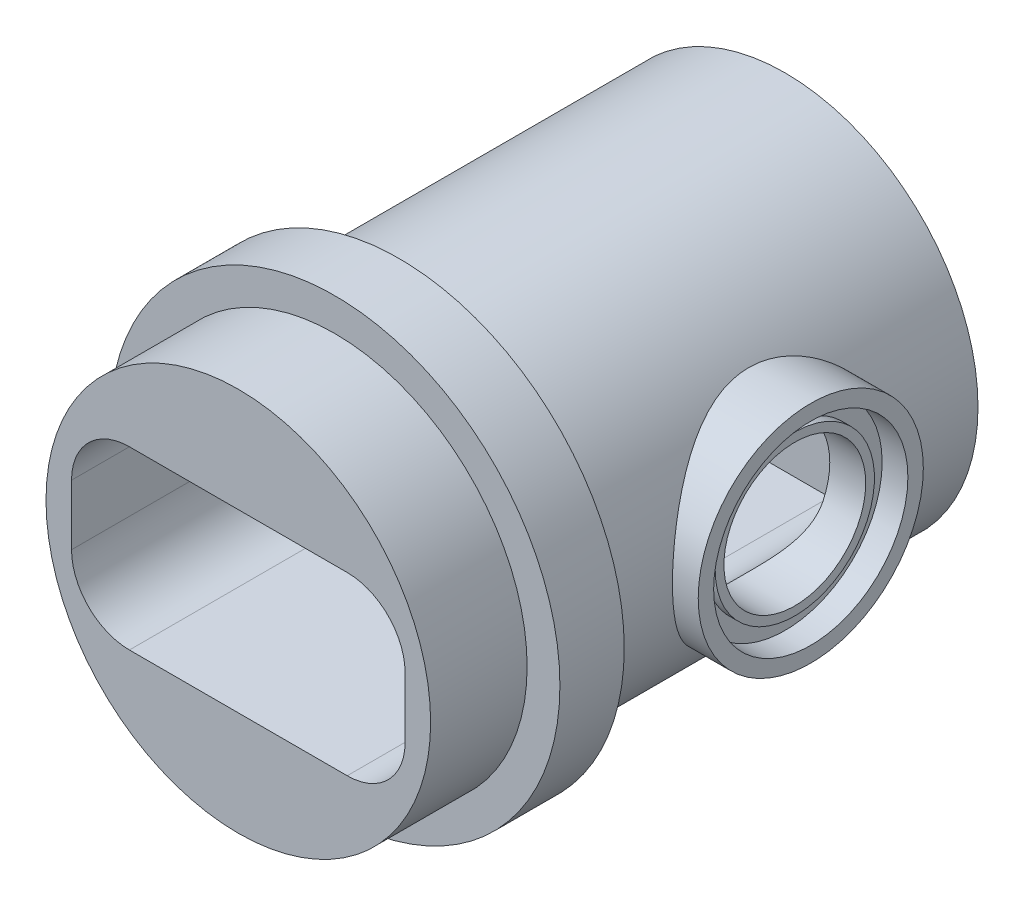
ISO-10303-21;
HEADER;
FILE_DESCRIPTION(('STEP AP214'),'2;1');
FILE_NAME('part.step','',(''),(''),'','','');
FILE_SCHEMA(('AUTOMOTIVE_DESIGN { 1 0 10303 214 1 1 1 1 }'));
ENDSEC;
DATA;
#1=APPLICATION_CONTEXT('core data for automotive mechanical design processes');
#2=APPLICATION_PROTOCOL_DEFINITION('international standard','automotive_design',2000,#1);
#3=PRODUCT_CONTEXT('',#1,'mechanical');
#4=PRODUCT('Part','Part','',(#3));
#5=PRODUCT_RELATED_PRODUCT_CATEGORY('part','',(#4));
#6=PRODUCT_DEFINITION_FORMATION('','',#4);
#7=PRODUCT_DEFINITION_CONTEXT('part definition',#1,'design');
#8=PRODUCT_DEFINITION('design','',#6,#7);
#9=PRODUCT_DEFINITION_SHAPE('','',#8);
#10=(LENGTH_UNIT() NAMED_UNIT(*) SI_UNIT(.MILLI.,.METRE.));
#11=(NAMED_UNIT(*) PLANE_ANGLE_UNIT() SI_UNIT($,.RADIAN.));
#12=(NAMED_UNIT(*) SI_UNIT($,.STERADIAN.) SOLID_ANGLE_UNIT());
#13=UNCERTAINTY_MEASURE_WITH_UNIT(LENGTH_MEASURE(1.E-05),#10,'distance_accuracy_value','');
#14=(GEOMETRIC_REPRESENTATION_CONTEXT(3) GLOBAL_UNCERTAINTY_ASSIGNED_CONTEXT((#13)) GLOBAL_UNIT_ASSIGNED_CONTEXT((#10,
#11,#12)) REPRESENTATION_CONTEXT('',''));
#15=CARTESIAN_POINT('',(0.,0.,0.));
#16=DIRECTION('',(0.,0.,1.));
#17=DIRECTION('',(1.,0.,0.));
#18=AXIS2_PLACEMENT_3D('',#15,#16,#17);
#19=CARTESIAN_POINT('',(38.1,0.,38.1));
#20=DIRECTION('',(1.,0.,0.));
#21=DIRECTION('',(0.,0.,-1.));
#22=AXIS2_PLACEMENT_3D('',#19,#20,#21);
#23=PLANE('',#22);
#24=CARTESIAN_POINT('',(38.1,0.,38.1));
#25=DIRECTION('',(1.,0.,0.));
#26=DIRECTION('',(0.,0.,-1.));
#27=AXIS2_PLACEMENT_3D('',#24,#25,#26);
#28=CIRCLE('',#27,19.177);
#29=CARTESIAN_POINT('',(38.1,0.,18.923));
#30=VERTEX_POINT('',#29);
#31=EDGE_CURVE('E466',#30,#30,#28,.T.);
#32=ORIENTED_EDGE('',*,*,#31,.T.);
#33=EDGE_LOOP('',(#32));
#34=FACE_BOUND('',#33,.T.);
#35=CARTESIAN_POINT('',(38.1,0.,38.1));
#36=DIRECTION('',(1.,0.,0.));
#37=DIRECTION('',(0.,0.,-1.));
#38=AXIS2_PLACEMENT_3D('',#35,#36,#37);
#39=CIRCLE('',#38,15.7226);
#40=CARTESIAN_POINT('',(38.1,0.,53.8226));
#41=VERTEX_POINT('',#40);
#42=EDGE_CURVE('E473',#41,#41,#39,.T.);
#43=ORIENTED_EDGE('',*,*,#42,.F.);
#44=EDGE_LOOP('',(#43));
#45=FACE_BOUND('',#44,.T.);
#46=ADVANCED_FACE('F51',(#34,#45),#23,.T.);
#47=CARTESIAN_POINT('',(11.938,0.,38.1));
#48=DIRECTION('',(1.,0.,0.));
#49=DIRECTION('',(0.,0.,-1.));
#50=AXIS2_PLACEMENT_3D('',#47,#48,#49);
#51=CYLINDRICAL_SURFACE('',#50,14.);
#52=CARTESIAN_POINT('',(32.9325,0.,38.1));
#53=DIRECTION('',(1.,0.,0.));
#54=DIRECTION('',(0.,0.,-1.));
#55=AXIS2_PLACEMENT_3D('',#52,#53,#54);
#56=CIRCLE('',#55,14.);
#57=CARTESIAN_POINT('',(32.9325,-5.94499999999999,25.424946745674));
#58=VERTEX_POINT('',#57);
#59=CARTESIAN_POINT('',(32.9325,5.945,25.424946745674));
#60=VERTEX_POINT('',#59);
#61=EDGE_CURVE('E72',#58,#60,#56,.T.);
#62=ORIENTED_EDGE('',*,*,#61,.F.);
#63=CARTESIAN_POINT('',(32.9325,-5.94499999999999,50.775053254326));
#64=CARTESIAN_POINT('',(32.9325016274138,-6.09733765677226,50.7036053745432));
#65=CARTESIAN_POINT('',(32.9294540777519,-6.24835146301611,50.6294205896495));
#66=CARTESIAN_POINT('',(32.9175950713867,-6.54740273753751,50.4757731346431));
#67=CARTESIAN_POINT('',(32.9087847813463,-6.69544080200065,50.3963115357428));
#68=CARTESIAN_POINT('',(32.8742504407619,-7.13416795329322,50.1505528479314));
#69=CARTESIAN_POINT('',(32.8404205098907,-7.42001555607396,49.9766256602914));
#70=CARTESIAN_POINT('',(32.7544721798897,-7.97374736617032,49.6120911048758));
#71=CARTESIAN_POINT('',(32.7025370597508,-8.24178068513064,49.4216647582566));
#72=CARTESIAN_POINT('',(32.5832044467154,-8.76174627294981,49.0242353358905));
#73=CARTESIAN_POINT('',(32.5158009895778,-9.01367228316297,48.8172258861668));
#74=CARTESIAN_POINT('',(32.3688898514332,-9.49892018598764,48.3895331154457));
#75=CARTESIAN_POINT('',(32.2894597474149,-9.73234766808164,48.168942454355));
#76=CARTESIAN_POINT('',(32.1209776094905,-10.1817941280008,47.7142218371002));
#77=CARTESIAN_POINT('',(32.0319266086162,-10.3978149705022,47.480093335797));
#78=CARTESIAN_POINT('',(31.8465725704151,-10.8129485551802,46.9984052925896));
#79=CARTESIAN_POINT('',(31.7502439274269,-11.0119958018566,46.7507992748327));
#80=CARTESIAN_POINT('',(31.5533563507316,-11.3921102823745,46.2437245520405));
#81=CARTESIAN_POINT('',(31.4527968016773,-11.5731748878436,45.9842541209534));
#82=CARTESIAN_POINT('',(31.228848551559,-11.9534480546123,45.3980538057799));
#83=CARTESIAN_POINT('',(31.1051229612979,-12.1484147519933,45.0686906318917));
#84=CARTESIAN_POINT('',(30.860782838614,-12.5112231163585,44.3941243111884));
#85=CARTESIAN_POINT('',(30.7401690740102,-12.6790581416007,44.0489173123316));
#86=CARTESIAN_POINT('',(30.5080085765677,-12.9865024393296,43.3438928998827));
#87=CARTESIAN_POINT('',(30.3964474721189,-13.1261569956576,42.9841000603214));
#88=CARTESIAN_POINT('',(30.1885420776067,-13.3762886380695,42.2502995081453));
#89=CARTESIAN_POINT('',(30.0921905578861,-13.4867796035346,41.8762986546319));
#90=CARTESIAN_POINT('',(29.9439931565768,-13.6518110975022,41.216279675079));
#91=CARTESIAN_POINT('',(29.8871160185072,-13.7134206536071,40.9331503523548));
#92=CARTESIAN_POINT('',(29.7878079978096,-13.8192528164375,40.3611495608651));
#93=CARTESIAN_POINT('',(29.745374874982,-13.8634781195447,40.0722789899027));
#94=CARTESIAN_POINT('',(29.6772409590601,-13.9337997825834,39.4909548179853));
#95=CARTESIAN_POINT('',(29.6515064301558,-13.9599327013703,39.1985096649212));
#96=CARTESIAN_POINT('',(29.618117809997,-13.99374054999,38.6115064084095));
#97=CARTESIAN_POINT('',(29.6104635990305,-14.0014156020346,38.316948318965));
#98=CARTESIAN_POINT('',(29.6137046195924,-13.9981524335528,37.7275200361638));
#99=CARTESIAN_POINT('',(29.6246325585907,-13.9871813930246,37.4326502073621));
#100=CARTESIAN_POINT('',(29.6644366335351,-13.9467797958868,36.8454204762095));
#101=CARTESIAN_POINT('',(29.6933130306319,-13.9173489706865,36.5530606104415));
#102=CARTESIAN_POINT('',(29.7674379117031,-13.8404757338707,35.9722736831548));
#103=CARTESIAN_POINT('',(29.8127178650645,-13.7929986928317,35.683855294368));
#104=CARTESIAN_POINT('',(29.9173166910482,-13.6807370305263,35.1130117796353));
#105=CARTESIAN_POINT('',(29.9766377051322,-13.6159497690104,34.8305875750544));
#106=CARTESIAN_POINT('',(30.1288599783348,-13.4448670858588,34.1776215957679));
#107=CARTESIAN_POINT('',(30.226314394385,-13.3319508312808,33.8098692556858));
#108=CARTESIAN_POINT('',(30.4352727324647,-13.0778470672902,33.0883795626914));
#109=CARTESIAN_POINT('',(30.5467819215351,-12.9366489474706,32.7346475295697));
#110=CARTESIAN_POINT('',(30.7780808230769,-12.6267642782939,32.0411717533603));
#111=CARTESIAN_POINT('',(30.8978899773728,-12.4580118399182,31.7014640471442));
#112=CARTESIAN_POINT('',(31.1400402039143,-12.0940246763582,31.0375737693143));
#113=CARTESIAN_POINT('',(31.2623809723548,-11.8987931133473,30.7133893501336));
#114=CARTESIAN_POINT('',(31.5079573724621,-11.4764602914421,30.072408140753));
#115=CARTESIAN_POINT('',(31.6311229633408,-11.2486226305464,29.7560688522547));
#116=CARTESIAN_POINT('',(31.8696724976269,-10.7657029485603,29.1416344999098));
#117=CARTESIAN_POINT('',(31.9850552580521,-10.5106168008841,28.8435422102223));
#118=CARTESIAN_POINT('',(32.2023930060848,-9.97493362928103,28.2687070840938));
#119=CARTESIAN_POINT('',(32.3044086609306,-9.69446237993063,27.9918703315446));
#120=CARTESIAN_POINT('',(32.4904853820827,-9.10785399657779,27.4602888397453));
#121=CARTESIAN_POINT('',(32.5745554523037,-8.80172984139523,27.2055330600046));
#122=CARTESIAN_POINT('',(32.6913505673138,-8.28900906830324,26.814956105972));
#123=CARTESIAN_POINT('',(32.7313367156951,-8.08992578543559,26.6713658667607));
#124=CARTESIAN_POINT('',(32.8014216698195,-7.68333343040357,26.3941513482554));
#125=CARTESIAN_POINT('',(32.8315242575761,-7.47582761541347,26.2605232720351));
#126=CARTESIAN_POINT('',(32.8807961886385,-7.05182271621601,26.0031575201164));
#127=CARTESIAN_POINT('',(32.8999011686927,-6.83527848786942,25.8794816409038));
#128=CARTESIAN_POINT('',(32.9257667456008,-6.39513793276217,25.6434828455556));
#129=CARTESIAN_POINT('',(32.9325164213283,-6.17153554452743,25.531170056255));
#130=CARTESIAN_POINT('',(32.9325,-5.94500000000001,25.424946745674));
#131=B_SPLINE_CURVE_WITH_KNOTS('',3,(#63,#64,#65,#66,#67,#68,#69,#70,#71,#72,#73,#74,#75,#76,
#77,#78,#79,#80,#81,#82,#83,#84,#85,#86,#87,#88,#89,#90,#91,#92,#93,#94,#95,#96,#97,#98,#99,
#100,#101,#102,#103,#104,#105,#106,#107,#108,#109,#110,#111,#112,#113,#114,#115,#116,#117,#118,
#119,#120,#121,#122,#123,#124,#125,#126,#127,#128,#129,#130),.UNSPECIFIED.,.F.,.F.,(4,2,2,2,2,2,
2,2,2,2,2,2,2,2,2,2,2,2,2,2,2,2,2,2,2,2,2,2,2,2,2,2,2,4),(0.,0.504660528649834,1.00921892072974,
2.01653536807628,3.01393743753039,4.01172473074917,5.00333038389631,5.99482967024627,
6.98999633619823,7.98530824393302,9.19078567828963,10.3965577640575,11.6003765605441,
12.8036214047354,13.6886623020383,14.5735658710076,15.4566760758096,16.3397804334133,
17.2244408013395,18.1091140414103,18.9954935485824,19.8820083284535,21.0707988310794,
22.2600361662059,23.4521600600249,24.6441417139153,25.8693346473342,27.0947133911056,
28.3143223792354,29.5333180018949,30.2789473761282,31.0242910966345,31.7739537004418,
32.5242786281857),.UNSPECIFIED.);
#132=CARTESIAN_POINT('',(32.9325,-5.94499999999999,50.775053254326));
#133=VERTEX_POINT('',#132);
#134=EDGE_CURVE('E14',#133,#58,#131,.T.);
#135=ORIENTED_EDGE('',*,*,#134,.F.);
#136=CARTESIAN_POINT('',(32.9325,5.945,50.775053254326));
#137=VERTEX_POINT('',#136);
#138=EDGE_CURVE('E134',#137,#133,#56,.T.);
#139=ORIENTED_EDGE('',*,*,#138,.F.);
#140=CARTESIAN_POINT('',(32.9325,5.94500000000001,25.424946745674));
#141=CARTESIAN_POINT('',(32.9325016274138,6.09733765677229,25.4963946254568));
#142=CARTESIAN_POINT('',(32.9294540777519,6.24835146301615,25.5705794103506));
#143=CARTESIAN_POINT('',(32.9175950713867,6.54740273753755,25.7242268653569));
#144=CARTESIAN_POINT('',(32.9087847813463,6.69544080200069,25.8036884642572));
#145=CARTESIAN_POINT('',(32.8742504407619,7.13416795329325,26.0494471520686));
#146=CARTESIAN_POINT('',(32.8404205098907,7.42001555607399,26.2233743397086));
#147=CARTESIAN_POINT('',(32.7544721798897,7.97374736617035,26.5879088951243));
#148=CARTESIAN_POINT('',(32.7025370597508,8.24178068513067,26.7783352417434));
#149=CARTESIAN_POINT('',(32.5832044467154,8.76174627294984,27.1757646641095));
#150=CARTESIAN_POINT('',(32.5158009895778,9.013672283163,27.3827741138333));
#151=CARTESIAN_POINT('',(32.3688898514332,9.49892018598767,27.8104668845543));
#152=CARTESIAN_POINT('',(32.2894597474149,9.73234766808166,28.031057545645));
#153=CARTESIAN_POINT('',(32.1209776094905,10.1817941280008,28.4857781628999));
#154=CARTESIAN_POINT('',(32.0319266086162,10.3978149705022,28.719906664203));
#155=CARTESIAN_POINT('',(31.8465725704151,10.8129485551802,29.2015947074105));
#156=CARTESIAN_POINT('',(31.7502439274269,11.0119958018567,29.4492007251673));
#157=CARTESIAN_POINT('',(31.5533563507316,11.3921102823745,29.9562754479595));
#158=CARTESIAN_POINT('',(31.4527968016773,11.5731748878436,30.2157458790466));
#159=CARTESIAN_POINT('',(31.228848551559,11.9534480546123,30.8019461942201));
#160=CARTESIAN_POINT('',(31.1051229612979,12.1484147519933,31.1313093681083));
#161=CARTESIAN_POINT('',(30.860782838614,12.5112231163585,31.8058756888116));
#162=CARTESIAN_POINT('',(30.7401690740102,12.6790581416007,32.1510826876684));
#163=CARTESIAN_POINT('',(30.5080085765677,12.9865024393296,32.8561071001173));
#164=CARTESIAN_POINT('',(30.3964474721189,13.1261569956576,33.2158999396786));
#165=CARTESIAN_POINT('',(30.1885420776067,13.3762886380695,33.9497004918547));
#166=CARTESIAN_POINT('',(30.0921905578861,13.4867796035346,34.3237013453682));
#167=CARTESIAN_POINT('',(29.9439931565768,13.6518110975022,34.9837203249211));
#168=CARTESIAN_POINT('',(29.8871160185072,13.7134206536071,35.2668496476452));
#169=CARTESIAN_POINT('',(29.7878079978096,13.8192528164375,35.8388504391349));
#170=CARTESIAN_POINT('',(29.745374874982,13.8634781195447,36.1277210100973));
#171=CARTESIAN_POINT('',(29.6772409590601,13.9337997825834,36.7090451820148));
#172=CARTESIAN_POINT('',(29.6515064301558,13.9599327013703,37.0014903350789));
#173=CARTESIAN_POINT('',(29.618117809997,13.99374054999,37.5884935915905));
#174=CARTESIAN_POINT('',(29.6104635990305,14.0014156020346,37.8830516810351));
#175=CARTESIAN_POINT('',(29.6137046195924,13.9981524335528,38.4724799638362));
#176=CARTESIAN_POINT('',(29.6246325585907,13.9871813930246,38.767349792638));
#177=CARTESIAN_POINT('',(29.6644366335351,13.9467797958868,39.3545795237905));
#178=CARTESIAN_POINT('',(29.693313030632,13.9173489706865,39.6469393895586));
#179=CARTESIAN_POINT('',(29.7674379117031,13.8404757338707,40.2277263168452));
#180=CARTESIAN_POINT('',(29.8127178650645,13.7929986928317,40.5161447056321));
#181=CARTESIAN_POINT('',(29.9173166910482,13.6807370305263,41.0869882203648));
#182=CARTESIAN_POINT('',(29.9766377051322,13.6159497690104,41.3694124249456));
#183=CARTESIAN_POINT('',(30.1288599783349,13.4448670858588,42.0223784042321));
#184=CARTESIAN_POINT('',(30.226314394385,13.3319508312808,42.3901307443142));
#185=CARTESIAN_POINT('',(30.4352727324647,13.0778470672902,43.1116204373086));
#186=CARTESIAN_POINT('',(30.5467819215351,12.9366489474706,43.4653524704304));
#187=CARTESIAN_POINT('',(30.7780808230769,12.6267642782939,44.1588282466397));
#188=CARTESIAN_POINT('',(30.8978899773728,12.4580118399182,44.4985359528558));
#189=CARTESIAN_POINT('',(31.1400402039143,12.0940246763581,45.1624262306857));
#190=CARTESIAN_POINT('',(31.2623809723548,11.8987931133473,45.4866106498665));
#191=CARTESIAN_POINT('',(31.5079573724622,11.4764602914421,46.127591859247));
#192=CARTESIAN_POINT('',(31.6311229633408,11.2486226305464,46.4439311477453));
#193=CARTESIAN_POINT('',(31.8696724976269,10.7657029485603,47.0583655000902));
#194=CARTESIAN_POINT('',(31.9850552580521,10.5106168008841,47.3564577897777));
#195=CARTESIAN_POINT('',(32.2023930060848,9.97493362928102,47.9312929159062));
#196=CARTESIAN_POINT('',(32.3044086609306,9.69446237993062,48.2081296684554));
#197=CARTESIAN_POINT('',(32.4904853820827,9.10785399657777,48.7397111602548));
#198=CARTESIAN_POINT('',(32.5745554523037,8.80172984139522,48.9944669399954));
#199=CARTESIAN_POINT('',(32.6913505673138,8.28900906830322,49.385043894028));
#200=CARTESIAN_POINT('',(32.7313367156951,8.08992578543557,49.5286341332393));
#201=CARTESIAN_POINT('',(32.8014216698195,7.68333343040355,49.8058486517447));
#202=CARTESIAN_POINT('',(32.8315242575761,7.47582761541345,49.9394767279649));
#203=CARTESIAN_POINT('',(32.8807961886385,7.05182271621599,50.1968424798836));
#204=CARTESIAN_POINT('',(32.8999011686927,6.83527848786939,50.3205183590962));
#205=CARTESIAN_POINT('',(32.9257667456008,6.39513793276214,50.5565171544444));
#206=CARTESIAN_POINT('',(32.9325164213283,6.1715355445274,50.668829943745));
#207=CARTESIAN_POINT('',(32.9325,5.94499999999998,50.775053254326));
#208=B_SPLINE_CURVE_WITH_KNOTS('',3,(#140,#141,#142,#143,#144,#145,#146,#147,#148,#149,#150,
#151,#152,#153,#154,#155,#156,#157,#158,#159,#160,#161,#162,#163,#164,#165,#166,#167,#168,#169,
#170,#171,#172,#173,#174,#175,#176,#177,#178,#179,#180,#181,#182,#183,#184,#185,#186,#187,#188,
#189,#190,#191,#192,#193,#194,#195,#196,#197,#198,#199,#200,#201,#202,#203,#204,#205,#206,#207),
.UNSPECIFIED.,.F.,.F.,(4,2,2,2,2,2,2,2,2,2,2,2,2,2,2,2,2,2,2,2,2,2,2,2,2,2,2,2,2,2,2,2,2,4),(0.,
0.504660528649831,1.00921892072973,2.01653536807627,3.01393743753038,4.01172473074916,
5.0033303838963,5.99482967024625,6.98999633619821,7.985308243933,9.19078567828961,
10.3965577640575,11.6003765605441,12.8036214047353,13.6886623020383,14.5735658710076,
15.4566760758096,16.3397804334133,17.2244408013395,18.1091140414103,18.9954935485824,
19.8820083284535,21.0707988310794,22.2600361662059,23.4521600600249,24.6441417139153,
25.8693346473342,27.0947133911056,28.3143223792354,29.5333180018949,30.2789473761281,
31.0242910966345,31.7739537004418,32.5242786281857),.UNSPECIFIED.);
#209=EDGE_CURVE('E147',#60,#137,#208,.T.);
#210=ORIENTED_EDGE('',*,*,#209,.F.);
#211=EDGE_LOOP('',(#62,#135,#139,#210));
#212=FACE_BOUND('',#211,.T.);
#213=CARTESIAN_POINT('',(40.0304,0.,38.1));
#214=DIRECTION('',(1.,0.,0.));
#215=DIRECTION('',(0.,0.,-1.));
#216=AXIS2_PLACEMENT_3D('',#213,#214,#215);
#217=CIRCLE('',#216,14.);
#218=CARTESIAN_POINT('',(40.0304,0.,24.1));
#219=VERTEX_POINT('',#218);
#220=EDGE_CURVE('E476',#219,#219,#217,.T.);
#221=ORIENTED_EDGE('',*,*,#220,.T.);
#222=EDGE_LOOP('',(#221));
#223=FACE_BOUND('',#222,.T.);
#224=ADVANCED_FACE('F132',(#212,#223),#51,.F.);
#225=CARTESIAN_POINT('',(32.9325,-17.375,-74.4698645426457));
#226=DIRECTION('',(1.,0.,0.));
#227=DIRECTION('',(0.,0.,-1.));
#228=AXIS2_PLACEMENT_3D('',#225,#226,#227);
#229=PLANE('',#228);
#230=DIRECTION('',(0.,0.,1.));
#231=VECTOR('',#230,1.);
#232=CARTESIAN_POINT('',(32.9325,5.945,12.7));
#233=LINE('',#232,#231);
#234=CARTESIAN_POINT('',(32.9325,5.94500000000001,107.95));
#235=VERTEX_POINT('',#234);
#236=EDGE_CURVE('E146',#235,#137,#233,.F.);
#237=ORIENTED_EDGE('',*,*,#236,.T.);
#238=ORIENTED_EDGE('',*,*,#138,.T.);
#239=DIRECTION('',(0.,0.,1.));
#240=VECTOR('',#239,1.);
#241=CARTESIAN_POINT('',(32.9325,-5.94499999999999,107.95));
#242=LINE('',#241,#240);
#243=CARTESIAN_POINT('',(32.9325,-5.94499999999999,107.95));
#244=VERTEX_POINT('',#243);
#245=EDGE_CURVE('E144',#133,#244,#242,.T.);
#246=ORIENTED_EDGE('',*,*,#245,.T.);
#247=DIRECTION('',(0.,1.,0.));
#248=VECTOR('',#247,1.);
#249=CARTESIAN_POINT('',(32.9325,-17.375,107.95));
#250=LINE('',#249,#248);
#251=EDGE_CURVE('E463',#244,#235,#250,.T.);
#252=ORIENTED_EDGE('',*,*,#251,.T.);
#253=EDGE_LOOP('',(#237,#238,#246,#252));
#254=FACE_BOUND('',#253,.T.);
#255=ADVANCED_FACE('F142',(#254),#229,.F.);
#256=CARTESIAN_POINT('',(0.,0.,76.2));
#257=DIRECTION('',(0.,0.,-1.));
#258=DIRECTION('',(-1.,0.,0.));
#259=AXIS2_PLACEMENT_3D('',#256,#257,#258);
#260=CYLINDRICAL_SURFACE('',#259,38.1);
#261=CARTESIAN_POINT('',(38.1,0.,15.875));
#262=CARTESIAN_POINT('',(38.0999963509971,-0.571259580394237,15.8750039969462));
#263=CARTESIAN_POINT('',(38.0871175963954,-1.14273821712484,15.8970618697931));
#264=CARTESIAN_POINT('',(38.035908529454,-2.28142502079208,15.9850229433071));
#265=CARTESIAN_POINT('',(37.9975608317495,-2.84863000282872,16.0509560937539));
#266=CARTESIAN_POINT('',(37.8962489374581,-3.97556521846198,16.2260105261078));
#267=CARTESIAN_POINT('',(37.8332239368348,-4.53527342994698,16.3352384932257));
#268=CARTESIAN_POINT('',(37.6841302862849,-5.64162251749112,16.5954503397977));
#269=CARTESIAN_POINT('',(37.5980653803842,-6.18826550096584,16.7464274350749));
#270=CARTESIAN_POINT('',(37.405401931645,-7.2623812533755,17.0875176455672));
#271=CARTESIAN_POINT('',(37.298907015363,-7.78993544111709,17.2774335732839));
#272=CARTESIAN_POINT('',(37.067478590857,-8.8257406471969,17.6948838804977));
#273=CARTESIAN_POINT('',(36.9425444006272,-9.33399095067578,17.9224196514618));
#274=CARTESIAN_POINT('',(36.6769427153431,-10.3284381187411,18.4129170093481));
#275=CARTESIAN_POINT('',(36.5362833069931,-10.8146461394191,18.6758604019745));
#276=CARTESIAN_POINT('',(36.2419863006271,-11.7632960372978,19.2352505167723));
#277=CARTESIAN_POINT('',(36.0883474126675,-12.2257355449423,19.5317005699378));
#278=CARTESIAN_POINT('',(35.7593028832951,-13.1584404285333,20.1792907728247));
#279=CARTESIAN_POINT('',(35.5831278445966,-13.6267516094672,20.5328548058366));
#280=CARTESIAN_POINT('',(35.2230230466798,-14.5322433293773,21.2742170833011));
#281=CARTESIAN_POINT('',(35.0390929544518,-14.969422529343,21.6620167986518));
#282=CARTESIAN_POINT('',(34.6672125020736,-15.8115940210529,22.4703746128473));
#283=CARTESIAN_POINT('',(34.479257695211,-16.2165481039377,22.8909704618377));
#284=CARTESIAN_POINT('',(34.1036698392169,-16.9922165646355,23.7627869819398));
#285=CARTESIAN_POINT('',(33.9160368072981,-17.3629291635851,24.2140092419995));
#286=CARTESIAN_POINT('',(33.5242014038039,-18.1089800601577,25.1988552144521));
#287=CARTESIAN_POINT('',(33.3205624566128,-18.4799857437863,25.7359977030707));
#288=CARTESIAN_POINT('',(32.9254374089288,-19.1751268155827,26.844201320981));
#289=CARTESIAN_POINT('',(32.7339531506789,-19.4992551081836,27.4152675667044));
#290=CARTESIAN_POINT('',(32.370162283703,-20.0973881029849,28.5879914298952));
#291=CARTESIAN_POINT('',(32.1978314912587,-20.371456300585,29.1896090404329));
#292=CARTESIAN_POINT('',(31.8790978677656,-20.8667192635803,30.4207744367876));
#293=CARTESIAN_POINT('',(31.7326860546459,-21.0879323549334,31.0503124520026));
#294=CARTESIAN_POINT('',(31.5024789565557,-21.4297909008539,32.1855328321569));
#295=CARTESIAN_POINT('',(31.4120256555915,-21.5618650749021,32.6864488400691));
#296=CARTESIAN_POINT('',(31.2533583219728,-21.7912161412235,33.6996401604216));
#297=CARTESIAN_POINT('',(31.1851409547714,-21.8884982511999,34.2119137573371));
#298=CARTESIAN_POINT('',(31.0733342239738,-22.0469346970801,35.2441829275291));
#299=CARTESIAN_POINT('',(31.0297209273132,-22.1081241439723,35.7641704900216));
#300=CARTESIAN_POINT('',(30.9686127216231,-22.1936435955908,36.8087266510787));
#301=CARTESIAN_POINT('',(30.9511183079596,-22.2179729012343,37.3332953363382));
#302=CARTESIAN_POINT('',(30.9429089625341,-22.2294048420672,38.3838874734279));
#303=CARTESIAN_POINT('',(30.9522367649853,-22.2164480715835,38.9099119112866));
#304=CARTESIAN_POINT('',(30.9974064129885,-22.1533807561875,39.9585688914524));
#305=CARTESIAN_POINT('',(31.0332483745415,-22.1032700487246,40.4812014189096));
#306=CARTESIAN_POINT('',(31.1301400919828,-21.9665964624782,41.5196059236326));
#307=CARTESIAN_POINT('',(31.1912051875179,-21.8800114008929,42.0353735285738));
#308=CARTESIAN_POINT('',(31.3363966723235,-21.6715558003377,43.0563920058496));
#309=CARTESIAN_POINT('',(31.4205236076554,-21.5496844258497,43.561642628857));
#310=CARTESIAN_POINT('',(31.6083845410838,-21.273168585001,44.5549749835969));
#311=CARTESIAN_POINT('',(31.7119622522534,-21.1187842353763,45.043159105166));
#312=CARTESIAN_POINT('',(31.9361976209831,-20.778133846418,46.0044250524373));
#313=CARTESIAN_POINT('',(32.0568621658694,-20.5918549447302,46.4775006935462));
#314=CARTESIAN_POINT('',(32.3121203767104,-20.1889504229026,47.4066281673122));
#315=CARTESIAN_POINT('',(32.446714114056,-19.9723246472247,47.8626799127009));
#316=CARTESIAN_POINT('',(32.7267278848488,-19.5101076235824,48.7564298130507));
#317=CARTESIAN_POINT('',(32.8721491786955,-19.2645130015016,49.1941258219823));
#318=CARTESIAN_POINT('',(33.1956467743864,-18.7024306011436,50.1212506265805));
#319=CARTESIAN_POINT('',(33.3751299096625,-18.3809467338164,50.6071660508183));
#320=CARTESIAN_POINT('',(33.7401128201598,-17.7020713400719,51.5508444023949));
#321=CARTESIAN_POINT('',(33.9256131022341,-17.3446767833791,52.0086049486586));
#322=CARTESIAN_POINT('',(34.298436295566,-16.5952566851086,52.894764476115));
#323=CARTESIAN_POINT('',(34.4857605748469,-16.2032030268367,53.3231391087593));
#324=CARTESIAN_POINT('',(34.8579494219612,-15.3861920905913,54.1484552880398));
#325=CARTESIAN_POINT('',(35.0428138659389,-14.9612331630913,54.54539525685));
#326=CARTESIAN_POINT('',(35.42871098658,-14.0251027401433,55.353270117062));
#327=CARTESIAN_POINT('',(35.6288989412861,-13.509779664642,55.7598168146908));
#328=CARTESIAN_POINT('',(36.0157751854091,-12.4417264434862,56.5278795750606));
#329=CARTESIAN_POINT('',(36.2024621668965,-11.8889926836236,56.8893912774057));
#330=CARTESIAN_POINT('',(36.5570778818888,-10.7492345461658,57.5638852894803));
#331=CARTESIAN_POINT('',(36.7250146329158,-10.1622249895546,57.8768883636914));
#332=CARTESIAN_POINT('',(37.0373218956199,-8.95733854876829,58.4509671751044));
#333=CARTESIAN_POINT('',(37.1816953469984,-8.33946552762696,58.712049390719));
#334=CARTESIAN_POINT('',(37.4336962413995,-7.11968050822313,59.1631150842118));
#335=CARTESIAN_POINT('',(37.5431374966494,-6.51947245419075,59.3566900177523));
#336=CARTESIAN_POINT('',(37.7345162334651,-5.30063113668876,59.6929033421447));
#337=CARTESIAN_POINT('',(37.8164546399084,-4.68199849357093,59.8355434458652));
#338=CARTESIAN_POINT('',(37.950293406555,-3.43217988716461,60.06757554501));
#339=CARTESIAN_POINT('',(38.0022205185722,-2.80100562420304,60.1570149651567));
#340=CARTESIAN_POINT('',(38.074510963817,-1.53153716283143,60.2813346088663));
#341=CARTESIAN_POINT('',(38.0948781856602,-0.893243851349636,60.3162215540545));
#342=CARTESIAN_POINT('',(38.1028763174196,0.302681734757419,60.3299291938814));
#343=CARTESIAN_POINT('',(38.0943485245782,0.86022646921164,60.3153286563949));
#344=CARTESIAN_POINT('',(38.0530097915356,1.9717024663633,60.2443678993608));
#345=CARTESIAN_POINT('',(38.0202013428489,2.52563409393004,60.1880119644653));
#346=CARTESIAN_POINT('',(37.9310957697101,3.62582646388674,60.0342782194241));
#347=CARTESIAN_POINT('',(37.8747989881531,4.17208731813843,59.9369010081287));
#348=CARTESIAN_POINT('',(37.7400410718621,5.25319584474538,59.7023270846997));
#349=CARTESIAN_POINT('',(37.6615793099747,5.78804319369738,59.5651292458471));
#350=CARTESIAN_POINT('',(37.4856764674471,6.83455635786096,59.2549664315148));
#351=CARTESIAN_POINT('',(37.3885564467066,7.34645538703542,59.0826038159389));
#352=CARTESIAN_POINT('',(37.1766016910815,8.3531367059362,58.7025534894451));
#353=CARTESIAN_POINT('',(37.061767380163,8.84791940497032,58.4948666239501));
#354=CARTESIAN_POINT('',(36.8166451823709,9.81809670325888,58.0459606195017));
#355=CARTESIAN_POINT('',(36.6863555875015,10.2934891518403,57.8047377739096));
#356=CARTESIAN_POINT('',(36.4127870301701,11.2229080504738,57.2905980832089));
#357=CARTESIAN_POINT('',(36.2695072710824,11.6769331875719,57.0176792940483));
#358=CARTESIAN_POINT('',(35.9570518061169,12.6081759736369,56.4118654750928));
#359=CARTESIAN_POINT('',(35.7867337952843,13.0828739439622,56.0756838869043));
#360=CARTESIAN_POINT('',(35.4370384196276,14.002440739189,55.3690068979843));
#361=CARTESIAN_POINT('',(35.2576605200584,14.4473077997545,54.9985094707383));
#362=CARTESIAN_POINT('',(34.8934197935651,15.3061110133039,54.2247636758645));
#363=CARTESIAN_POINT('',(34.7085512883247,15.7200134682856,53.8214805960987));
#364=CARTESIAN_POINT('',(34.3374441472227,16.5149134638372,52.984270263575));
#365=CARTESIAN_POINT('',(34.1512054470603,16.8959094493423,52.550341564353));
#366=CARTESIAN_POINT('',(33.7593400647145,17.667079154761,51.5997405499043));
#367=CARTESIAN_POINT('',(33.5540596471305,18.0528971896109,51.0793799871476));
#368=CARTESIAN_POINT('',(33.1530295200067,18.7792118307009,50.0043143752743));
#369=CARTESIAN_POINT('',(32.9572812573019,19.1197015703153,49.4496041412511));
#370=CARTESIAN_POINT('',(32.5820285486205,19.75238186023,48.3087731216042));
#371=CARTESIAN_POINT('',(32.4025082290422,20.0446198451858,47.7226839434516));
#372=CARTESIAN_POINT('',(32.0663284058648,20.5781459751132,46.5215228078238));
#373=CARTESIAN_POINT('',(31.9096618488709,20.819449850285,45.9064598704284));
#374=CARTESIAN_POINT('',(31.6565686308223,21.2017044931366,44.7864855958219));
#375=CARTESIAN_POINT('',(31.5544359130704,21.3530751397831,44.2864004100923));
#376=CARTESIAN_POINT('',(31.3715260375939,21.6209089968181,43.2731412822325));
#377=CARTESIAN_POINT('',(31.2907459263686,21.737377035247,42.7599691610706));
#378=CARTESIAN_POINT('',(31.1533289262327,21.9338665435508,41.7240506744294));
#379=CARTESIAN_POINT('',(31.0966664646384,22.013926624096,41.2013150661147));
#380=CARTESIAN_POINT('',(31.0094210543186,22.1366554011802,40.1492777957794));
#381=CARTESIAN_POINT('',(30.9788384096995,22.1793236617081,39.6199760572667));
#382=CARTESIAN_POINT('',(30.9448834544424,22.2266744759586,38.5573533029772));
#383=CARTESIAN_POINT('',(30.9415851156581,22.2312537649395,38.0240252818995));
#384=CARTESIAN_POINT('',(30.9625230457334,22.2020827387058,36.9589672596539));
#385=CARTESIAN_POINT('',(30.9867594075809,22.1683322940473,36.4272372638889));
#386=CARTESIAN_POINT('',(31.0618428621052,22.063002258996,35.3691796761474));
#387=CARTESIAN_POINT('',(31.1127039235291,21.9914028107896,34.8428550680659));
#388=CARTESIAN_POINT('',(31.239153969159,21.8114032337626,33.799586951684));
#389=CARTESIAN_POINT('',(31.3147432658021,21.7030026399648,33.282643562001));
#390=CARTESIAN_POINT('',(31.4854554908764,21.4545582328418,32.2765068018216));
#391=CARTESIAN_POINT('',(31.579930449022,21.315551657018,31.7869453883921));
#392=CARTESIAN_POINT('',(31.7869406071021,21.0055973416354,30.8217762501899));
#393=CARTESIAN_POINT('',(31.8994830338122,20.8346368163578,30.3461741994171));
#394=CARTESIAN_POINT('',(32.1396018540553,20.4622832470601,29.4109886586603));
#395=CARTESIAN_POINT('',(32.2671782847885,20.2608901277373,28.9514052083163));
#396=CARTESIAN_POINT('',(32.5343317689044,19.8290624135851,28.0496832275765));
#397=CARTESIAN_POINT('',(32.6739102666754,19.5986243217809,27.6075468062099));
#398=CARTESIAN_POINT('',(32.9844055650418,19.0721331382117,26.6748587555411));
#399=CARTESIAN_POINT('',(33.1568271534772,18.7714456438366,26.1874197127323));
#400=CARTESIAN_POINT('',(33.5092568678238,18.1348308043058,25.23902061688));
#401=CARTESIAN_POINT('',(33.6892655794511,17.7989007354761,24.7780626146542));
#402=CARTESIAN_POINT('',(34.05279482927,17.0931220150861,23.883795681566));
#403=CARTESIAN_POINT('',(34.2363177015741,16.723250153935,23.4505060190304));
#404=CARTESIAN_POINT('',(34.6027679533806,15.9512090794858,22.6134322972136));
#405=CARTESIAN_POINT('',(34.7856952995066,15.5490380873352,22.2096498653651));
#406=CARTESIAN_POINT('',(35.1725289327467,14.6551158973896,21.3787268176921));
#407=CARTESIAN_POINT('',(35.375775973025,14.1587143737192,20.9562625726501));
#408=CARTESIAN_POINT('',(35.7711403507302,13.1278445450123,20.1546194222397));
#409=CARTESIAN_POINT('',(35.9632564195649,12.5933719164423,19.7754454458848));
#410=CARTESIAN_POINT('',(36.33122565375,11.4887347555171,19.0634164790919));
#411=CARTESIAN_POINT('',(36.5070723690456,10.9185562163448,18.7305798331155));
#412=CARTESIAN_POINT('',(36.8374404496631,9.74596505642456,18.1148770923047));
#413=CARTESIAN_POINT('',(36.9919649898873,9.14355725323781,17.8320035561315));
#414=CARTESIAN_POINT('',(37.2683972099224,7.9397534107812,17.3318660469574));
#415=CARTESIAN_POINT('',(37.391503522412,7.3396621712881,17.1121282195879));
#416=CARTESIAN_POINT('',(37.6106909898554,6.11807977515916,16.7240702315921));
#417=CARTESIAN_POINT('',(37.7067674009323,5.49658488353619,16.5557590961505));
#418=CARTESIAN_POINT('',(37.8686498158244,4.23975512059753,16.2736726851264));
#419=CARTESIAN_POINT('',(37.9345584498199,3.60447499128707,16.159712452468));
#420=CARTESIAN_POINT('',(38.0344460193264,2.32429899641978,15.9874540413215));
#421=CARTESIAN_POINT('',(38.0684534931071,1.67941225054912,15.9291061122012));
#422=CARTESIAN_POINT('',(38.0906590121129,0.861065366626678,15.891016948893));
#423=CARTESIAN_POINT('',(38.0941601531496,0.688933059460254,15.8850124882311));
#424=CARTESIAN_POINT('',(38.0988312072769,0.344540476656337,15.8770033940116));
#425=CARTESIAN_POINT('',(38.1000011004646,0.172280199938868,15.8749987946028));
#426=CARTESIAN_POINT('',(38.1,0.,15.875));
#427=B_SPLINE_CURVE_WITH_KNOTS('',3,(#261,#262,#263,#264,#265,#266,#267,#268,#269,#270,#271,
#272,#273,#274,#275,#276,#277,#278,#279,#280,#281,#282,#283,#284,#285,#286,#287,#288,#289,#290,
#291,#292,#293,#294,#295,#296,#297,#298,#299,#300,#301,#302,#303,#304,#305,#306,#307,#308,#309,
#310,#311,#312,#313,#314,#315,#316,#317,#318,#319,#320,#321,#322,#323,#324,#325,#326,#327,#328,
#329,#330,#331,#332,#333,#334,#335,#336,#337,#338,#339,#340,#341,#342,#343,#344,#345,#346,#347,
#348,#349,#350,#351,#352,#353,#354,#355,#356,#357,#358,#359,#360,#361,#362,#363,#364,#365,#366,
#367,#368,#369,#370,#371,#372,#373,#374,#375,#376,#377,#378,#379,#380,#381,#382,#383,#384,#385,
#386,#387,#388,#389,#390,#391,#392,#393,#394,#395,#396,#397,#398,#399,#400,#401,#402,#403,#404,
#405,#406,#407,#408,#409,#410,#411,#412,#413,#414,#415,#416,#417,#418,#419,#420,#421,#422,#423,
#424,#425,#426),.UNSPECIFIED.,.T.,.F.,(4,2,2,2,2,2,2,2,2,2,2,2,2,2,2,2,2,2,2,2,2,2,2,2,2,2,2,2,
2,2,2,2,2,2,2,2,2,2,2,2,2,2,2,2,2,2,2,2,2,2,2,2,2,2,2,2,2,2,2,2,2,2,2,2,2,2,2,2,2,2,2,2,2,2,2,2,
2,2,2,2,2,2,4),(0.,1.71359209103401,3.42835510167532,5.14737009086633,6.86610590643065,
8.57634392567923,10.2866452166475,11.9960709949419,13.7056668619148,15.5418007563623,
17.3780135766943,19.2163720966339,21.0548260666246,23.1038316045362,25.1531469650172,
27.1998446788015,29.2458317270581,30.8218523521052,32.3976365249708,33.9718852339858,
35.5461637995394,37.1229519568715,38.6997470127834,40.2775024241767,41.8552951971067,
43.4209144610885,44.987166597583,46.5534267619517,48.1198695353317,49.9470077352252,
51.7743002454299,53.6030889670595,55.4319694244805,57.4880683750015,59.5443662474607,
61.5997814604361,63.6549400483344,65.572412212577,67.4898198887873,69.4055157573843,
71.3209755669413,72.9923177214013,74.6634883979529,76.334634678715,78.0058282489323,
79.6504924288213,81.2951172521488,82.9399239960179,84.5848316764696,86.4012928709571,
88.2178614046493,90.0363789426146,91.8549823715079,93.8911687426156,95.9276632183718,
97.962143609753,99.9959947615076,101.591549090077,103.186882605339,104.780520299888,
106.374176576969,107.972152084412,109.570132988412,111.168953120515,112.76779345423,
114.319072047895,115.870972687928,117.42287716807,118.974968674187,120.767540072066,
122.56025010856,124.354195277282,126.148239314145,128.194096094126,130.240185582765,
132.2870828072,134.333674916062,136.283284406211,138.233235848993,140.176503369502,
142.118030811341,142.634810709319,143.15159501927),.UNSPECIFIED.);
#428=CARTESIAN_POINT('',(38.1,0.,15.875));
#429=VERTEX_POINT('',#428);
#430=EDGE_CURVE('E213',#429,#429,#427,.T.);
#431=ORIENTED_EDGE('',*,*,#430,.T.);
#432=EDGE_LOOP('',(#431));
#433=FACE_BOUND('',#432,.T.);
#434=CARTESIAN_POINT('',(0.,0.,76.2));
#435=DIRECTION('',(0.,0.,1.));
#436=DIRECTION('',(1.,0.,0.));
#437=AXIS2_PLACEMENT_3D('',#434,#435,#436);
#438=CIRCLE('',#437,38.1);
#439=CARTESIAN_POINT('',(38.1,0.,76.2));
#440=VERTEX_POINT('',#439);
#441=EDGE_CURVE('E228',#440,#440,#438,.T.);
#442=ORIENTED_EDGE('',*,*,#441,.F.);
#443=EDGE_LOOP('',(#442));
#444=FACE_BOUND('',#443,.T.);
#445=CARTESIAN_POINT('',(0.,0.,0.));
#446=DIRECTION('',(0.,0.,1.));
#447=DIRECTION('',(1.,0.,0.));
#448=AXIS2_PLACEMENT_3D('',#445,#446,#447);
#449=CIRCLE('',#448,38.1);
#450=CARTESIAN_POINT('',(38.1,0.,0.));
#451=VERTEX_POINT('',#450);
#452=EDGE_CURVE('E232',#451,#451,#449,.T.);
#453=ORIENTED_EDGE('',*,*,#452,.T.);
#454=EDGE_LOOP('',(#453));
#455=FACE_BOUND('',#454,.T.);
#456=ADVANCED_FACE('F245',(#433,#444,#455),#260,.T.);
#457=CARTESIAN_POINT('',(0.,0.,0.));
#458=DIRECTION('',(0.,0.,1.));
#459=DIRECTION('',(1.,0.,0.));
#460=AXIS2_PLACEMENT_3D('',#457,#458,#459);
#461=PLANE('',#460);
#462=ORIENTED_EDGE('',*,*,#452,.F.);
#463=EDGE_LOOP('',(#462));
#464=FACE_BOUND('',#463,.T.);
#465=ADVANCED_FACE('F273',(#464),#461,.F.);
#466=CARTESIAN_POINT('',(0.,0.,88.9));
#467=DIRECTION('',(0.,0.,-1.));
#468=DIRECTION('',(-1.,0.,0.));
#469=AXIS2_PLACEMENT_3D('',#466,#467,#468);
#470=CYLINDRICAL_SURFACE('',#469,44.45);
#471=CARTESIAN_POINT('',(0.,0.,88.9));
#472=DIRECTION('',(0.,0.,1.));
#473=DIRECTION('',(1.,0.,0.));
#474=AXIS2_PLACEMENT_3D('',#471,#472,#473);
#475=CIRCLE('',#474,44.45);
#476=CARTESIAN_POINT('',(44.45,0.,88.9));
#477=VERTEX_POINT('',#476);
#478=EDGE_CURVE('E229',#477,#477,#475,.T.);
#479=ORIENTED_EDGE('',*,*,#478,.F.);
#480=EDGE_LOOP('',(#479));
#481=FACE_BOUND('',#480,.T.);
#482=CARTESIAN_POINT('',(0.,0.,76.2));
#483=DIRECTION('',(0.,0.,1.));
#484=DIRECTION('',(1.,0.,0.));
#485=AXIS2_PLACEMENT_3D('',#482,#483,#484);
#486=CIRCLE('',#485,44.45);
#487=CARTESIAN_POINT('',(44.45,0.,76.2));
#488=VERTEX_POINT('',#487);
#489=EDGE_CURVE('E224',#488,#488,#486,.T.);
#490=ORIENTED_EDGE('',*,*,#489,.T.);
#491=EDGE_LOOP('',(#490));
#492=FACE_BOUND('',#491,.T.);
#493=ADVANCED_FACE('F267',(#481,#492),#470,.T.);
#494=CARTESIAN_POINT('',(0.,0.,88.9));
#495=DIRECTION('',(0.,0.,1.));
#496=DIRECTION('',(1.,0.,0.));
#497=AXIS2_PLACEMENT_3D('',#494,#495,#496);
#498=PLANE('',#497);
#499=CARTESIAN_POINT('',(0.,0.,88.9));
#500=DIRECTION('',(0.,0.,1.));
#501=DIRECTION('',(1.,0.,0.));
#502=AXIS2_PLACEMENT_3D('',#499,#500,#501);
#503=CIRCLE('',#502,37.973);
#504=CARTESIAN_POINT('',(-37.973,0.,88.9));
#505=VERTEX_POINT('',#504);
#506=EDGE_CURVE('E225',#505,#505,#503,.T.);
#507=ORIENTED_EDGE('',*,*,#506,.F.);
#508=EDGE_LOOP('',(#507));
#509=FACE_BOUND('',#508,.T.);
#510=ORIENTED_EDGE('',*,*,#478,.T.);
#511=EDGE_LOOP('',(#510));
#512=FACE_BOUND('',#511,.T.);
#513=ADVANCED_FACE('F264',(#509,#512),#498,.T.);
#514=CARTESIAN_POINT('',(0.,0.,76.2));
#515=DIRECTION('',(0.,0.,1.));
#516=DIRECTION('',(1.,0.,0.));
#517=AXIS2_PLACEMENT_3D('',#514,#515,#516);
#518=PLANE('',#517);
#519=ORIENTED_EDGE('',*,*,#441,.T.);
#520=EDGE_LOOP('',(#519));
#521=FACE_BOUND('',#520,.T.);
#522=ORIENTED_EDGE('',*,*,#489,.F.);
#523=EDGE_LOOP('',(#522));
#524=FACE_BOUND('',#523,.T.);
#525=ADVANCED_FACE('F262',(#521,#524),#518,.F.);
#526=CARTESIAN_POINT('',(0.,0.,107.95));
#527=DIRECTION('',(0.,0.,-1.));
#528=DIRECTION('',(-1.,0.,0.));
#529=AXIS2_PLACEMENT_3D('',#526,#527,#528);
#530=CYLINDRICAL_SURFACE('',#529,37.973);
#531=CARTESIAN_POINT('',(0.,0.,107.95));
#532=DIRECTION('',(0.,0.,1.));
#533=DIRECTION('',(1.,0.,0.));
#534=AXIS2_PLACEMENT_3D('',#531,#532,#533);
#535=CIRCLE('',#534,37.973);
#536=CARTESIAN_POINT('',(-37.973,0.,107.95));
#537=VERTEX_POINT('',#536);
#538=EDGE_CURVE('E221',#537,#537,#535,.T.);
#539=CARTESIAN_POINT('',(-37.973,0.,107.95));
#540=CARTESIAN_POINT('',(-37.973,0.,107.7515625));
#541=CARTESIAN_POINT('',(-37.973,0.,107.553125));
#542=CARTESIAN_POINT('',(-37.973,0.,107.15625));
#543=CARTESIAN_POINT('',(-37.973,0.,106.9578125));
#544=CARTESIAN_POINT('',(-37.973,0.,106.5609375));
#545=CARTESIAN_POINT('',(-37.973,0.,106.3625));
#546=CARTESIAN_POINT('',(-37.973,0.,105.965625));
#547=CARTESIAN_POINT('',(-37.973,0.,105.7671875));
#548=CARTESIAN_POINT('',(-37.973,0.,105.3703125));
#549=CARTESIAN_POINT('',(-37.973,0.,105.171875));
#550=CARTESIAN_POINT('',(-37.973,0.,104.775));
#551=CARTESIAN_POINT('',(-37.973,0.,104.5765625));
#552=CARTESIAN_POINT('',(-37.973,0.,104.1796875));
#553=CARTESIAN_POINT('',(-37.973,0.,103.98125));
#554=CARTESIAN_POINT('',(-37.973,0.,103.584375));
#555=CARTESIAN_POINT('',(-37.973,0.,103.3859375));
#556=CARTESIAN_POINT('',(-37.973,0.,102.9890625));
#557=CARTESIAN_POINT('',(-37.973,0.,102.790625));
#558=CARTESIAN_POINT('',(-37.973,0.,102.39375));
#559=CARTESIAN_POINT('',(-37.973,0.,102.1953125));
#560=CARTESIAN_POINT('',(-37.973,0.,101.7984375));
#561=CARTESIAN_POINT('',(-37.973,0.,101.6));
#562=CARTESIAN_POINT('',(-37.973,0.,101.203125));
#563=CARTESIAN_POINT('',(-37.973,0.,101.0046875));
#564=CARTESIAN_POINT('',(-37.973,0.,100.6078125));
#565=CARTESIAN_POINT('',(-37.973,0.,100.409375));
#566=CARTESIAN_POINT('',(-37.973,0.,100.0125));
#567=CARTESIAN_POINT('',(-37.973,0.,99.8140625));
#568=CARTESIAN_POINT('',(-37.973,0.,99.4171875));
#569=CARTESIAN_POINT('',(-37.973,0.,99.21875));
#570=CARTESIAN_POINT('',(-37.973,0.,98.821875));
#571=CARTESIAN_POINT('',(-37.973,0.,98.6234375));
#572=CARTESIAN_POINT('',(-37.973,0.,98.2265625));
#573=CARTESIAN_POINT('',(-37.973,0.,98.028125));
#574=CARTESIAN_POINT('',(-37.973,0.,97.63125));
#575=CARTESIAN_POINT('',(-37.973,0.,97.4328125));
#576=CARTESIAN_POINT('',(-37.973,0.,97.0359375));
#577=CARTESIAN_POINT('',(-37.973,0.,96.8375));
#578=CARTESIAN_POINT('',(-37.973,0.,96.440625));
#579=CARTESIAN_POINT('',(-37.973,0.,96.2421875));
#580=CARTESIAN_POINT('',(-37.973,0.,95.8453125));
#581=CARTESIAN_POINT('',(-37.973,0.,95.646875));
#582=CARTESIAN_POINT('',(-37.973,0.,95.25));
#583=CARTESIAN_POINT('',(-37.973,0.,95.0515625));
#584=CARTESIAN_POINT('',(-37.973,0.,94.6546875));
#585=CARTESIAN_POINT('',(-37.973,0.,94.45625));
#586=CARTESIAN_POINT('',(-37.973,0.,94.059375));
#587=CARTESIAN_POINT('',(-37.973,0.,93.8609375));
#588=CARTESIAN_POINT('',(-37.973,0.,93.4640625));
#589=CARTESIAN_POINT('',(-37.973,0.,93.265625));
#590=CARTESIAN_POINT('',(-37.973,0.,92.86875));
#591=CARTESIAN_POINT('',(-37.973,0.,92.6703125));
#592=CARTESIAN_POINT('',(-37.973,0.,92.2734375));
#593=CARTESIAN_POINT('',(-37.973,0.,92.075));
#594=CARTESIAN_POINT('',(-37.973,0.,91.678125));
#595=CARTESIAN_POINT('',(-37.973,0.,91.4796875));
#596=CARTESIAN_POINT('',(-37.973,0.,91.0828125));
#597=CARTESIAN_POINT('',(-37.973,0.,90.884375));
#598=CARTESIAN_POINT('',(-37.973,0.,90.4875));
#599=CARTESIAN_POINT('',(-37.973,0.,90.2890625));
#600=CARTESIAN_POINT('',(-37.973,0.,89.8921875));
#601=CARTESIAN_POINT('',(-37.973,0.,89.69375));
#602=CARTESIAN_POINT('',(-37.973,0.,89.296875));
#603=CARTESIAN_POINT('',(-37.973,0.,89.0984375));
#604=CARTESIAN_POINT('',(-37.973,0.,88.9));
#605=B_SPLINE_CURVE_WITH_KNOTS('',3,(#539,#540,#541,#542,#543,#544,#545,#546,#547,#548,#549,
#550,#551,#552,#553,#554,#555,#556,#557,#558,#559,#560,#561,#562,#563,#564,#565,#566,#567,#568,
#569,#570,#571,#572,#573,#574,#575,#576,#577,#578,#579,#580,#581,#582,#583,#584,#585,#586,#587,
#588,#589,#590,#591,#592,#593,#594,#595,#596,#597,#598,#599,#600,#601,#602,#603,#604),
.UNSPECIFIED.,.F.,.F.,(4,2,2,2,2,2,2,2,2,2,2,2,2,2,2,2,2,2,2,2,2,2,2,2,2,2,2,2,2,2,2,2,4),(0.,
0.5953125,1.190625,1.7859375,2.38125,2.9765625,3.571875,4.1671875,4.7625,5.3578125,5.953125,
6.5484375,7.14375,7.7390625,8.334375,8.92968750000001,9.52500000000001,10.1203125,10.715625,
11.3109375,11.90625,12.5015625,13.096875,13.6921875,14.2875,14.8828125,15.478125,16.0734375,
16.66875,17.2640625,17.859375,18.4546875,19.05),.UNSPECIFIED.);
#606=EDGE_CURVE('BSEAM259',#537,#505,#605,.T.);
#607=ORIENTED_EDGE('',*,*,#538,.F.);
#608=ORIENTED_EDGE('',*,*,#506,.T.);
#609=ORIENTED_EDGE('',*,*,#606,.T.);
#610=ORIENTED_EDGE('',*,*,#606,.F.);
#611=EDGE_LOOP('',(#607,#609,#608,#610));
#612=FACE_BOUND('',#611,.T.);
#613=ADVANCED_FACE('F259',(#612),#530,.T.);
#614=CARTESIAN_POINT('',(0.,0.,107.95));
#615=DIRECTION('',(0.,0.,1.));
#616=DIRECTION('',(1.,0.,0.));
#617=AXIS2_PLACEMENT_3D('',#614,#615,#616);
#618=PLANE('',#617);
#619=DIRECTION('',(0.,-1.,0.));
#620=VECTOR('',#619,1.);
#621=CARTESIAN_POINT('',(-32.9325,-17.375,107.95));
#622=LINE('',#621,#620);
#623=CARTESIAN_POINT('',(-32.9325,5.945,107.95));
#624=VERTEX_POINT('',#623);
#625=CARTESIAN_POINT('',(-32.9325,-5.945,107.95));
#626=VERTEX_POINT('',#625);
#627=EDGE_CURVE('E187',#624,#626,#622,.T.);
#628=ORIENTED_EDGE('',*,*,#627,.F.);
#629=CARTESIAN_POINT('',(-21.5025,5.945,107.95));
#630=DIRECTION('',(0.,0.,1.));
#631=DIRECTION('',(1.,0.,0.));
#632=AXIS2_PLACEMENT_3D('',#629,#630,#631);
#633=CIRCLE('',#632,11.43);
#634=CARTESIAN_POINT('',(-21.5025,17.375,107.95));
#635=VERTEX_POINT('',#634);
#636=EDGE_CURVE('E180',#624,#635,#633,.F.);
#637=ORIENTED_EDGE('',*,*,#636,.T.);
#638=DIRECTION('',(-1.,0.,0.));
#639=VECTOR('',#638,1.);
#640=CARTESIAN_POINT('',(32.9325,17.375,107.95));
#641=LINE('',#640,#639);
#642=CARTESIAN_POINT('',(21.5025,17.375,107.95));
#643=VERTEX_POINT('',#642);
#644=EDGE_CURVE('E218',#643,#635,#641,.T.);
#645=ORIENTED_EDGE('',*,*,#644,.F.);
#646=CARTESIAN_POINT('',(21.5025,5.945,107.95));
#647=DIRECTION('',(0.,0.,1.));
#648=DIRECTION('',(1.,0.,0.));
#649=AXIS2_PLACEMENT_3D('',#646,#647,#648);
#650=CIRCLE('',#649,11.43);
#651=EDGE_CURVE('E178',#643,#235,#650,.F.);
#652=ORIENTED_EDGE('',*,*,#651,.T.);
#653=ORIENTED_EDGE('',*,*,#251,.F.);
#654=CARTESIAN_POINT('',(21.5025,-5.94499999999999,107.95));
#655=DIRECTION('',(0.,0.,1.));
#656=DIRECTION('',(1.,0.,0.));
#657=AXIS2_PLACEMENT_3D('',#654,#655,#656);
#658=CIRCLE('',#657,11.43);
#659=CARTESIAN_POINT('',(21.5025,-17.375,107.95));
#660=VERTEX_POINT('',#659);
#661=EDGE_CURVE('E65',#244,#660,#658,.F.);
#662=ORIENTED_EDGE('',*,*,#661,.T.);
#663=DIRECTION('',(1.,0.,0.));
#664=VECTOR('',#663,1.);
#665=CARTESIAN_POINT('',(32.9325,-17.375,107.95));
#666=LINE('',#665,#664);
#667=CARTESIAN_POINT('',(-21.5025,-17.375,107.95));
#668=VERTEX_POINT('',#667);
#669=EDGE_CURVE('E188',#668,#660,#666,.T.);
#670=ORIENTED_EDGE('',*,*,#669,.F.);
#671=CARTESIAN_POINT('',(-21.5025,-5.945,107.95));
#672=DIRECTION('',(0.,0.,1.));
#673=DIRECTION('',(1.,0.,0.));
#674=AXIS2_PLACEMENT_3D('',#671,#672,#673);
#675=CIRCLE('',#674,11.43);
#676=EDGE_CURVE('E182',#668,#626,#675,.F.);
#677=ORIENTED_EDGE('',*,*,#676,.T.);
#678=EDGE_LOOP('',(#628,#637,#645,#652,#653,#662,#670,#677));
#679=FACE_BOUND('',#678,.T.);
#680=ORIENTED_EDGE('',*,*,#538,.T.);
#681=EDGE_LOOP('',(#680));
#682=FACE_BOUND('',#681,.T.);
#683=ADVANCED_FACE('F185',(#679,#682),#618,.T.);
#684=CARTESIAN_POINT('',(27.94,0.,38.1));
#685=DIRECTION('',(1.,0.,0.));
#686=DIRECTION('',(0.,0.,-1.));
#687=AXIS2_PLACEMENT_3D('',#684,#685,#686);
#688=CYLINDRICAL_SURFACE('',#687,22.225);
#689=CARTESIAN_POINT('',(43.18,0.,38.1));
#690=DIRECTION('',(1.,0.,0.));
#691=DIRECTION('',(0.,0.,-1.));
#692=AXIS2_PLACEMENT_3D('',#689,#690,#691);
#693=CIRCLE('',#692,22.225);
#694=CARTESIAN_POINT('',(43.18,0.,15.875));
#695=VERTEX_POINT('',#694);
#696=EDGE_CURVE('E210',#695,#695,#693,.T.);
#697=ORIENTED_EDGE('',*,*,#696,.F.);
#698=EDGE_LOOP('',(#697));
#699=FACE_BOUND('',#698,.T.);
#700=ORIENTED_EDGE('',*,*,#430,.F.);
#701=EDGE_LOOP('',(#700));
#702=FACE_BOUND('',#701,.T.);
#703=ADVANCED_FACE('F249',(#699,#702),#688,.T.);
#704=CARTESIAN_POINT('',(43.18,0.,38.1));
#705=DIRECTION('',(1.,0.,0.));
#706=DIRECTION('',(0.,0.,-1.));
#707=AXIS2_PLACEMENT_3D('',#704,#705,#706);
#708=PLANE('',#707);
#709=CARTESIAN_POINT('',(43.18,0.,38.1));
#710=DIRECTION('',(1.,0.,0.));
#711=DIRECTION('',(0.,0.,-1.));
#712=AXIS2_PLACEMENT_3D('',#709,#710,#711);
#713=CIRCLE('',#712,19.177);
#714=CARTESIAN_POINT('',(43.18,0.,18.923));
#715=VERTEX_POINT('',#714);
#716=EDGE_CURVE('E467',#715,#715,#713,.T.);
#717=ORIENTED_EDGE('',*,*,#716,.F.);
#718=EDGE_LOOP('',(#717));
#719=FACE_BOUND('',#718,.T.);
#720=ORIENTED_EDGE('',*,*,#696,.T.);
#721=EDGE_LOOP('',(#720));
#722=FACE_BOUND('',#721,.T.);
#723=ADVANCED_FACE('F254',(#719,#722),#708,.T.);
#724=CARTESIAN_POINT('',(-32.9325,-17.375,-74.4698645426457));
#725=DIRECTION('',(-1.,0.,0.));
#726=DIRECTION('',(0.,0.,1.));
#727=AXIS2_PLACEMENT_3D('',#724,#725,#726);
#728=PLANE('',#727);
#729=DIRECTION('',(0.,1.,0.));
#730=VECTOR('',#729,1.);
#731=CARTESIAN_POINT('',(-32.9325,-17.375,12.7));
#732=LINE('',#731,#730);
#733=CARTESIAN_POINT('',(-32.9325,-5.945,12.7));
#734=VERTEX_POINT('',#733);
#735=CARTESIAN_POINT('',(-32.9325,5.945,12.7));
#736=VERTEX_POINT('',#735);
#737=EDGE_CURVE('E207',#734,#736,#732,.T.);
#738=ORIENTED_EDGE('',*,*,#737,.T.);
#739=DIRECTION('',(0.,0.,1.));
#740=VECTOR('',#739,1.);
#741=CARTESIAN_POINT('',(-32.9325,5.945,107.95));
#742=LINE('',#741,#740);
#743=EDGE_CURVE('E170',#736,#624,#742,.T.);
#744=ORIENTED_EDGE('',*,*,#743,.T.);
#745=ORIENTED_EDGE('',*,*,#627,.T.);
#746=DIRECTION('',(0.,0.,1.));
#747=VECTOR('',#746,1.);
#748=CARTESIAN_POINT('',(-32.9325,-5.945,12.7));
#749=LINE('',#748,#747);
#750=EDGE_CURVE('E168',#626,#734,#749,.F.);
#751=ORIENTED_EDGE('',*,*,#750,.T.);
#752=EDGE_LOOP('',(#738,#744,#745,#751));
#753=FACE_BOUND('',#752,.T.);
#754=ADVANCED_FACE('F194',(#753),#728,.F.);
#755=CARTESIAN_POINT('',(32.9325,17.375,-74.4698645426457));
#756=DIRECTION('',(0.,1.,0.));
#757=DIRECTION('',(-1.,0.,0.));
#758=AXIS2_PLACEMENT_3D('',#755,#756,#757);
#759=PLANE('',#758);
#760=DIRECTION('',(1.,0.,0.));
#761=VECTOR('',#760,1.);
#762=CARTESIAN_POINT('',(32.9325,17.375,12.7));
#763=LINE('',#762,#761);
#764=CARTESIAN_POINT('',(-21.5025,17.375,12.7));
#765=VERTEX_POINT('',#764);
#766=CARTESIAN_POINT('',(21.5025,17.375,12.7));
#767=VERTEX_POINT('',#766);
#768=EDGE_CURVE('E215',#765,#767,#763,.T.);
#769=ORIENTED_EDGE('',*,*,#768,.T.);
#770=DIRECTION('',(0.,0.,1.));
#771=VECTOR('',#770,1.);
#772=CARTESIAN_POINT('',(21.5025,17.375,107.95));
#773=LINE('',#772,#771);
#774=EDGE_CURVE('E151',#767,#643,#773,.T.);
#775=ORIENTED_EDGE('',*,*,#774,.T.);
#776=ORIENTED_EDGE('',*,*,#644,.T.);
#777=DIRECTION('',(0.,0.,1.));
#778=VECTOR('',#777,1.);
#779=CARTESIAN_POINT('',(-21.5025,17.375,12.7));
#780=LINE('',#779,#778);
#781=EDGE_CURVE('E155',#635,#765,#780,.F.);
#782=ORIENTED_EDGE('',*,*,#781,.T.);
#783=EDGE_LOOP('',(#769,#775,#776,#782));
#784=FACE_BOUND('',#783,.T.);
#785=ADVANCED_FACE('F402',(#784),#759,.F.);
#786=CARTESIAN_POINT('',(32.9325,-5.94499999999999,12.7));
#787=VERTEX_POINT('',#786);
#788=EDGE_CURVE('E150',#787,#58,#242,.T.);
#789=ORIENTED_EDGE('',*,*,#788,.T.);
#790=ORIENTED_EDGE('',*,*,#61,.T.);
#791=CARTESIAN_POINT('',(32.9325,5.94500000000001,12.7));
#792=VERTEX_POINT('',#791);
#793=EDGE_CURVE('E153',#60,#792,#233,.F.);
#794=ORIENTED_EDGE('',*,*,#793,.T.);
#795=DIRECTION('',(0.,-1.,0.));
#796=VECTOR('',#795,1.);
#797=CARTESIAN_POINT('',(32.9325,-17.375,12.7));
#798=LINE('',#797,#796);
#799=EDGE_CURVE('E309',#792,#787,#798,.T.);
#800=ORIENTED_EDGE('',*,*,#799,.T.);
#801=EDGE_LOOP('',(#789,#790,#794,#800));
#802=FACE_BOUND('',#801,.T.);
#803=ADVANCED_FACE('F369',(#802),#229,.F.);
#804=CARTESIAN_POINT('',(32.9325,-17.375,-74.4698645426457));
#805=DIRECTION('',(0.,-1.,0.));
#806=DIRECTION('',(1.,0.,0.));
#807=AXIS2_PLACEMENT_3D('',#804,#805,#806);
#808=PLANE('',#807);
#809=DIRECTION('',(-1.,0.,0.));
#810=VECTOR('',#809,1.);
#811=CARTESIAN_POINT('',(32.9325,-17.375,12.7));
#812=LINE('',#811,#810);
#813=CARTESIAN_POINT('',(21.5025,-17.375,12.7));
#814=VERTEX_POINT('',#813);
#815=CARTESIAN_POINT('',(-21.5025,-17.375,12.7));
#816=VERTEX_POINT('',#815);
#817=EDGE_CURVE('E205',#814,#816,#812,.T.);
#818=ORIENTED_EDGE('',*,*,#817,.T.);
#819=DIRECTION('',(0.,0.,1.));
#820=VECTOR('',#819,1.);
#821=CARTESIAN_POINT('',(-21.5025,-17.375,107.95));
#822=LINE('',#821,#820);
#823=EDGE_CURVE('E175',#816,#668,#822,.T.);
#824=ORIENTED_EDGE('',*,*,#823,.T.);
#825=ORIENTED_EDGE('',*,*,#669,.T.);
#826=DIRECTION('',(0.,0.,1.));
#827=VECTOR('',#826,1.);
#828=CARTESIAN_POINT('',(21.5025,-17.375,12.7));
#829=LINE('',#828,#827);
#830=EDGE_CURVE('E173',#660,#814,#829,.F.);
#831=ORIENTED_EDGE('',*,*,#830,.T.);
#832=EDGE_LOOP('',(#818,#824,#825,#831));
#833=FACE_BOUND('',#832,.T.);
#834=ADVANCED_FACE('F209',(#833),#808,.F.);
#835=CARTESIAN_POINT('',(0.,0.,12.7));
#836=DIRECTION('',(0.,0.,1.));
#837=DIRECTION('',(1.,0.,0.));
#838=AXIS2_PLACEMENT_3D('',#835,#836,#837);
#839=PLANE('',#838);
#840=ORIENTED_EDGE('',*,*,#799,.F.);
#841=CARTESIAN_POINT('',(21.5025,5.945,12.7));
#842=DIRECTION('',(0.,0.,1.));
#843=DIRECTION('',(1.,0.,0.));
#844=AXIS2_PLACEMENT_3D('',#841,#842,#843);
#845=CIRCLE('',#844,11.43);
#846=EDGE_CURVE('E166',#792,#767,#845,.T.);
#847=ORIENTED_EDGE('',*,*,#846,.T.);
#848=ORIENTED_EDGE('',*,*,#768,.F.);
#849=CARTESIAN_POINT('',(-21.5025,5.945,12.7));
#850=DIRECTION('',(0.,0.,1.));
#851=DIRECTION('',(1.,0.,0.));
#852=AXIS2_PLACEMENT_3D('',#849,#850,#851);
#853=CIRCLE('',#852,11.43);
#854=EDGE_CURVE('E164',#765,#736,#853,.T.);
#855=ORIENTED_EDGE('',*,*,#854,.T.);
#856=ORIENTED_EDGE('',*,*,#737,.F.);
#857=CARTESIAN_POINT('',(-21.5025,-5.945,12.7));
#858=DIRECTION('',(0.,0.,1.));
#859=DIRECTION('',(1.,0.,0.));
#860=AXIS2_PLACEMENT_3D('',#857,#858,#859);
#861=CIRCLE('',#860,11.43);
#862=EDGE_CURVE('E162',#734,#816,#861,.T.);
#863=ORIENTED_EDGE('',*,*,#862,.T.);
#864=ORIENTED_EDGE('',*,*,#817,.F.);
#865=CARTESIAN_POINT('',(21.5025,-5.94499999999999,12.7));
#866=DIRECTION('',(0.,0.,1.));
#867=DIRECTION('',(1.,0.,0.));
#868=AXIS2_PLACEMENT_3D('',#865,#866,#867);
#869=CIRCLE('',#868,11.43);
#870=EDGE_CURVE('E160',#814,#787,#869,.T.);
#871=ORIENTED_EDGE('',*,*,#870,.T.);
#872=EDGE_LOOP('',(#840,#847,#848,#855,#856,#863,#864,#871));
#873=FACE_BOUND('',#872,.T.);
#874=ADVANCED_FACE('F204',(#873),#839,.T.);
#875=CARTESIAN_POINT('',(21.5025,5.945,-74.4698645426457));
#876=DIRECTION('',(0.,0.,-1.));
#877=DIRECTION('',(-1.,0.,0.));
#878=AXIS2_PLACEMENT_3D('',#875,#876,#877);
#879=CYLINDRICAL_SURFACE('',#878,11.43);
#880=ORIENTED_EDGE('',*,*,#793,.F.);
#881=ORIENTED_EDGE('',*,*,#209,.T.);
#882=ORIENTED_EDGE('',*,*,#236,.F.);
#883=ORIENTED_EDGE('',*,*,#651,.F.);
#884=ORIENTED_EDGE('',*,*,#774,.F.);
#885=ORIENTED_EDGE('',*,*,#846,.F.);
#886=EDGE_LOOP('',(#880,#881,#882,#883,#884,#885));
#887=FACE_BOUND('',#886,.T.);
#888=ADVANCED_FACE('F311',(#887),#879,.F.);
#889=CARTESIAN_POINT('',(-21.5025,5.945,-74.4698645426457));
#890=DIRECTION('',(0.,0.,-1.));
#891=DIRECTION('',(-1.,0.,0.));
#892=AXIS2_PLACEMENT_3D('',#889,#890,#891);
#893=CYLINDRICAL_SURFACE('',#892,11.43);
#894=ORIENTED_EDGE('',*,*,#854,.F.);
#895=ORIENTED_EDGE('',*,*,#781,.F.);
#896=ORIENTED_EDGE('',*,*,#636,.F.);
#897=ORIENTED_EDGE('',*,*,#743,.F.);
#898=EDGE_LOOP('',(#894,#895,#896,#897));
#899=FACE_BOUND('',#898,.T.);
#900=ADVANCED_FACE('F315',(#899),#893,.F.);
#901=CARTESIAN_POINT('',(-21.5025,-5.945,-74.4698645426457));
#902=DIRECTION('',(0.,0.,-1.));
#903=DIRECTION('',(-1.,0.,0.));
#904=AXIS2_PLACEMENT_3D('',#901,#902,#903);
#905=CYLINDRICAL_SURFACE('',#904,11.43);
#906=ORIENTED_EDGE('',*,*,#862,.F.);
#907=ORIENTED_EDGE('',*,*,#750,.F.);
#908=ORIENTED_EDGE('',*,*,#676,.F.);
#909=ORIENTED_EDGE('',*,*,#823,.F.);
#910=EDGE_LOOP('',(#906,#907,#908,#909));
#911=FACE_BOUND('',#910,.T.);
#912=ADVANCED_FACE('F199',(#911),#905,.F.);
#913=CARTESIAN_POINT('',(21.5025,-5.94499999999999,-74.4698645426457));
#914=DIRECTION('',(0.,0.,-1.));
#915=DIRECTION('',(-1.,0.,0.));
#916=AXIS2_PLACEMENT_3D('',#913,#914,#915);
#917=CYLINDRICAL_SURFACE('',#916,11.43);
#918=ORIENTED_EDGE('',*,*,#245,.F.);
#919=ORIENTED_EDGE('',*,*,#134,.T.);
#920=ORIENTED_EDGE('',*,*,#788,.F.);
#921=ORIENTED_EDGE('',*,*,#870,.F.);
#922=ORIENTED_EDGE('',*,*,#830,.F.);
#923=ORIENTED_EDGE('',*,*,#661,.F.);
#924=EDGE_LOOP('',(#918,#919,#920,#921,#922,#923));
#925=FACE_BOUND('',#924,.T.);
#926=ADVANCED_FACE('F53',(#925),#917,.F.);
#927=CARTESIAN_POINT('',(38.1,0.,38.1));
#928=DIRECTION('',(1.,0.,0.));
#929=DIRECTION('',(0.,0.,-1.));
#930=AXIS2_PLACEMENT_3D('',#927,#928,#929);
#931=CYLINDRICAL_SURFACE('',#930,19.177);
#932=ORIENTED_EDGE('',*,*,#31,.F.);
#933=EDGE_LOOP('',(#932));
#934=FACE_BOUND('',#933,.T.);
#935=ORIENTED_EDGE('',*,*,#716,.T.);
#936=EDGE_LOOP('',(#935));
#937=FACE_BOUND('',#936,.T.);
#938=ADVANCED_FACE('F294',(#934,#937),#931,.F.);
#939=CARTESIAN_POINT('',(40.0304,0.,38.1));
#940=DIRECTION('',(1.,0.,0.));
#941=DIRECTION('',(0.,0.,-1.));
#942=AXIS2_PLACEMENT_3D('',#939,#940,#941);
#943=PLANE('',#942);
#944=CARTESIAN_POINT('',(40.0304,0.,38.1));
#945=DIRECTION('',(1.,0.,0.));
#946=DIRECTION('',(0.,0.,-1.));
#947=AXIS2_PLACEMENT_3D('',#944,#945,#946);
#948=CIRCLE('',#947,15.7226);
#949=CARTESIAN_POINT('',(40.0304,0.,53.8226));
#950=VERTEX_POINT('',#949);
#951=EDGE_CURVE('E471',#950,#950,#948,.T.);
#952=ORIENTED_EDGE('',*,*,#951,.T.);
#953=EDGE_LOOP('',(#952));
#954=FACE_BOUND('',#953,.T.);
#955=ORIENTED_EDGE('',*,*,#220,.F.);
#956=EDGE_LOOP('',(#955));
#957=FACE_BOUND('',#956,.T.);
#958=ADVANCED_FACE('F296',(#954,#957),#943,.T.);
#959=CARTESIAN_POINT('',(40.0304,0.,38.1));
#960=DIRECTION('',(-1.,0.,0.));
#961=DIRECTION('',(0.,0.,1.));
#962=AXIS2_PLACEMENT_3D('',#959,#960,#961);
#963=CYLINDRICAL_SURFACE('',#962,15.7226);
#964=CARTESIAN_POINT('',(40.0304,0.,53.8226));
#965=CARTESIAN_POINT('',(40.0102916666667,0.,53.8226));
#966=CARTESIAN_POINT('',(39.9901833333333,0.,53.8226));
#967=CARTESIAN_POINT('',(39.9499666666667,0.,53.8226));
#968=CARTESIAN_POINT('',(39.9298583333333,0.,53.8226));
#969=CARTESIAN_POINT('',(39.8896416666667,0.,53.8226));
#970=CARTESIAN_POINT('',(39.8695333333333,0.,53.8226));
#971=CARTESIAN_POINT('',(39.8293166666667,0.,53.8226));
#972=CARTESIAN_POINT('',(39.8092083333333,0.,53.8226));
#973=CARTESIAN_POINT('',(39.7689916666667,0.,53.8226));
#974=CARTESIAN_POINT('',(39.7488833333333,0.,53.8226));
#975=CARTESIAN_POINT('',(39.7086666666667,0.,53.8226));
#976=CARTESIAN_POINT('',(39.6885583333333,0.,53.8226));
#977=CARTESIAN_POINT('',(39.6483416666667,0.,53.8226));
#978=CARTESIAN_POINT('',(39.6282333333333,0.,53.8226));
#979=CARTESIAN_POINT('',(39.5880166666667,0.,53.8226));
#980=CARTESIAN_POINT('',(39.5679083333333,0.,53.8226));
#981=CARTESIAN_POINT('',(39.5276916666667,0.,53.8226));
#982=CARTESIAN_POINT('',(39.5075833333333,0.,53.8226));
#983=CARTESIAN_POINT('',(39.4673666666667,0.,53.8226));
#984=CARTESIAN_POINT('',(39.4472583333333,0.,53.8226));
#985=CARTESIAN_POINT('',(39.4070416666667,0.,53.8226));
#986=CARTESIAN_POINT('',(39.3869333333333,0.,53.8226));
#987=CARTESIAN_POINT('',(39.3467166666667,0.,53.8226));
#988=CARTESIAN_POINT('',(39.3266083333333,0.,53.8226));
#989=CARTESIAN_POINT('',(39.2863916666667,0.,53.8226));
#990=CARTESIAN_POINT('',(39.2662833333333,0.,53.8226));
#991=CARTESIAN_POINT('',(39.2260666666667,0.,53.8226));
#992=CARTESIAN_POINT('',(39.2059583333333,0.,53.8226));
#993=CARTESIAN_POINT('',(39.1657416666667,0.,53.8226));
#994=CARTESIAN_POINT('',(39.1456333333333,0.,53.8226));
#995=CARTESIAN_POINT('',(39.1054166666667,0.,53.8226));
#996=CARTESIAN_POINT('',(39.0853083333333,0.,53.8226));
#997=CARTESIAN_POINT('',(39.0450916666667,0.,53.8226));
#998=CARTESIAN_POINT('',(39.0249833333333,0.,53.8226));
#999=CARTESIAN_POINT('',(38.9847666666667,0.,53.8226));
#1000=CARTESIAN_POINT('',(38.9646583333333,0.,53.8226));
#1001=CARTESIAN_POINT('',(38.9244416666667,0.,53.8226));
#1002=CARTESIAN_POINT('',(38.9043333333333,0.,53.8226));
#1003=CARTESIAN_POINT('',(38.8641166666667,0.,53.8226));
#1004=CARTESIAN_POINT('',(38.8440083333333,0.,53.8226));
#1005=CARTESIAN_POINT('',(38.8037916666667,0.,53.8226));
#1006=CARTESIAN_POINT('',(38.7836833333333,0.,53.8226));
#1007=CARTESIAN_POINT('',(38.7434666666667,0.,53.8226));
#1008=CARTESIAN_POINT('',(38.7233583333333,0.,53.8226));
#1009=CARTESIAN_POINT('',(38.6831416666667,0.,53.8226));
#1010=CARTESIAN_POINT('',(38.6630333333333,0.,53.8226));
#1011=CARTESIAN_POINT('',(38.6228166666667,0.,53.8226));
#1012=CARTESIAN_POINT('',(38.6027083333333,0.,53.8226));
#1013=CARTESIAN_POINT('',(38.5624916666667,0.,53.8226));
#1014=CARTESIAN_POINT('',(38.5423833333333,0.,53.8226));
#1015=CARTESIAN_POINT('',(38.5021666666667,0.,53.8226));
#1016=CARTESIAN_POINT('',(38.4820583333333,0.,53.8226));
#1017=CARTESIAN_POINT('',(38.4418416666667,0.,53.8226));
#1018=CARTESIAN_POINT('',(38.4217333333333,0.,53.8226));
#1019=CARTESIAN_POINT('',(38.3815166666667,0.,53.8226));
#1020=CARTESIAN_POINT('',(38.3614083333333,0.,53.8226));
#1021=CARTESIAN_POINT('',(38.3211916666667,0.,53.8226));
#1022=CARTESIAN_POINT('',(38.3010833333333,0.,53.8226));
#1023=CARTESIAN_POINT('',(38.2608666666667,0.,53.8226));
#1024=CARTESIAN_POINT('',(38.2407583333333,0.,53.8226));
#1025=CARTESIAN_POINT('',(38.2005416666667,0.,53.8226));
#1026=CARTESIAN_POINT('',(38.1804333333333,0.,53.8226));
#1027=CARTESIAN_POINT('',(38.1402166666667,0.,53.8226));
#1028=CARTESIAN_POINT('',(38.1201083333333,0.,53.8226));
#1029=CARTESIAN_POINT('',(38.1,0.,53.8226));
#1030=B_SPLINE_CURVE_WITH_KNOTS('',3,(#964,#965,#966,#967,#968,#969,#970,#971,#972,#973,#974,
#975,#976,#977,#978,#979,#980,#981,#982,#983,#984,#985,#986,#987,#988,#989,#990,#991,#992,#993,
#994,#995,#996,#997,#998,#999,#1000,#1001,#1002,#1003,#1004,#1005,#1006,#1007,#1008,#1009,#1010,
#1011,#1012,#1013,#1014,#1015,#1016,#1017,#1018,#1019,#1020,#1021,#1022,#1023,#1024,#1025,#1026,
#1027,#1028,#1029),.UNSPECIFIED.,.F.,.F.,(4,2,2,2,2,2,2,2,2,2,2,2,2,2,2,2,2,2,2,2,2,2,2,2,2,2,2,
2,2,2,2,2,4),(0.,0.060325,0.12065,0.180975,0.2413,0.301624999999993,0.36195,0.422275,0.4826,
0.542924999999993,0.603249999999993,0.663574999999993,0.7239,0.784225,0.844549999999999,
0.904874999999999,0.965199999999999,1.02552499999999,1.08584999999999,1.14617499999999,
1.20649999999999,1.26682499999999,1.32714999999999,1.38747499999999,1.4478,1.508125,1.56845,
1.628775,1.6891,1.749425,1.80975,1.870075,1.9304),.UNSPECIFIED.);
#1031=EDGE_CURVE('BSEAM292',#950,#41,#1030,.T.);
#1032=ORIENTED_EDGE('',*,*,#951,.F.);
#1033=ORIENTED_EDGE('',*,*,#42,.T.);
#1034=ORIENTED_EDGE('',*,*,#1031,.T.);
#1035=ORIENTED_EDGE('',*,*,#1031,.F.);
#1036=EDGE_LOOP('',(#1032,#1034,#1033,#1035));
#1037=FACE_BOUND('',#1036,.T.);
#1038=ADVANCED_FACE('F292',(#1037),#963,.T.);
#1039=CLOSED_SHELL('',(#46,#224,#255,#456,#465,#493,#513,#525,#613,#683,#703,#723,#754,#785,
#803,#834,#874,#888,#900,#912,#926,#938,#958,#1038));
#1040=MANIFOLD_SOLID_BREP('B2',#1039);
#1041=ADVANCED_BREP_SHAPE_REPRESENTATION('',(#18,#1040),#14);
#1042=SHAPE_DEFINITION_REPRESENTATION(#9,#1041);
ENDSEC;
END-ISO-10303-21;
